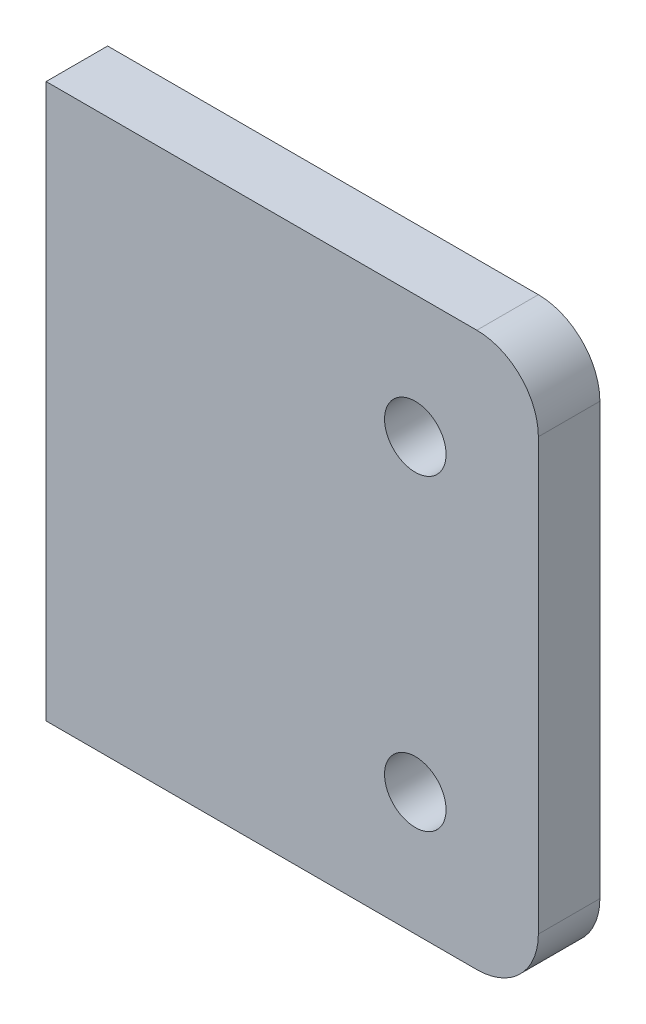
from build123d import *

# Parameters (mm, degrees)
SKETCH1_R      = 3.175
EXTRUDE1_DEPTH = 6.35


with BuildPart() as part:
    # Sketch1 → Extrude1 (new body)
    with BuildSketch(Plane.XY):
        with BuildLine():
            Line((0, 28.575), (44.45, 28.575))
            ThreePointArc((44.45, 28.575), (48.940128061, 26.715128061), (50.8, 22.225))
            Line((50.8, 22.225), (50.8, -22.225))
            ThreePointArc((50.8, -22.225), (48.940128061, -26.715128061), (44.45, -28.575))
            Line((44.45, -28.575), (0, -28.575))
            Line((0, -28.575), (0, 28.575))
        make_face()
        with Locations((38.1, 15.875)):
            Circle(SKETCH1_R, mode=Mode.SUBTRACT)
        with Locations((38.1, -15.875)):
            Circle(SKETCH1_R, mode=Mode.SUBTRACT)
    extrude(amount=EXTRUDE1_DEPTH)


solid = part.part
